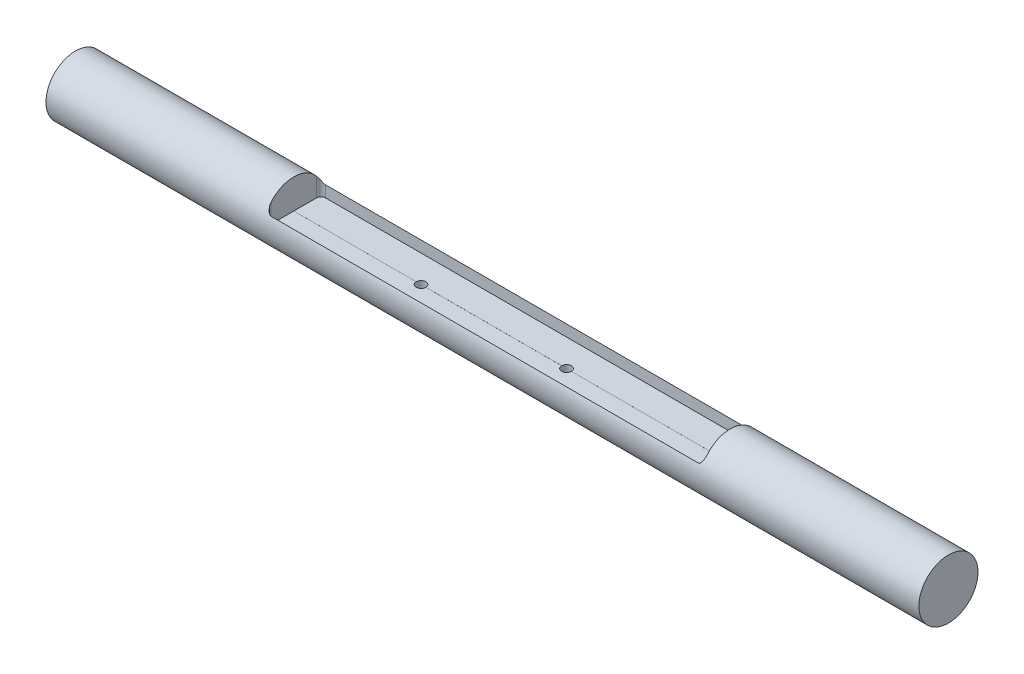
ISO-10303-21;
HEADER;
FILE_DESCRIPTION(('STEP AP214'),'2;1');
FILE_NAME('part.step','',(''),(''),'','','');
FILE_SCHEMA(('AUTOMOTIVE_DESIGN { 1 0 10303 214 1 1 1 1 }'));
ENDSEC;
DATA;
#1=APPLICATION_CONTEXT('core data for automotive mechanical design processes');
#2=APPLICATION_PROTOCOL_DEFINITION('international standard','automotive_design',2000,#1);
#3=PRODUCT_CONTEXT('',#1,'mechanical');
#4=PRODUCT('Part','Part','',(#3));
#5=PRODUCT_RELATED_PRODUCT_CATEGORY('part','',(#4));
#6=PRODUCT_DEFINITION_FORMATION('','',#4);
#7=PRODUCT_DEFINITION_CONTEXT('part definition',#1,'design');
#8=PRODUCT_DEFINITION('design','',#6,#7);
#9=PRODUCT_DEFINITION_SHAPE('','',#8);
#10=(LENGTH_UNIT() NAMED_UNIT(*) SI_UNIT(.MILLI.,.METRE.));
#11=(NAMED_UNIT(*) PLANE_ANGLE_UNIT() SI_UNIT($,.RADIAN.));
#12=(NAMED_UNIT(*) SI_UNIT($,.STERADIAN.) SOLID_ANGLE_UNIT());
#13=UNCERTAINTY_MEASURE_WITH_UNIT(LENGTH_MEASURE(1.E-05),#10,'distance_accuracy_value','');
#14=(GEOMETRIC_REPRESENTATION_CONTEXT(3) GLOBAL_UNCERTAINTY_ASSIGNED_CONTEXT((#13)) GLOBAL_UNIT_ASSIGNED_CONTEXT((#10,
#11,#12)) REPRESENTATION_CONTEXT('',''));
#15=CARTESIAN_POINT('',(0.,0.,0.));
#16=DIRECTION('',(0.,0.,1.));
#17=DIRECTION('',(1.,0.,0.));
#18=AXIS2_PLACEMENT_3D('',#15,#16,#17);
#19=CARTESIAN_POINT('',(304.8,0.,0.));
#20=DIRECTION('',(-1.,0.,0.));
#21=DIRECTION('',(0.,0.,1.));
#22=AXIS2_PLACEMENT_3D('',#19,#20,#21);
#23=CYLINDRICAL_SURFACE('',#22,0.0127000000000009);
#24=CARTESIAN_POINT('',(41.4781761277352,0.,0.0127000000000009));
#25=CARTESIAN_POINT('',(41.4781761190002,-0.000714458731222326,0.0127006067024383));
#26=CARTESIAN_POINT('',(41.4781763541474,-0.00142873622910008,0.0126397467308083));
#27=CARTESIAN_POINT('',(41.4781772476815,-0.00283657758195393,0.0123995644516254));
#28=CARTESIAN_POINT('',(41.4781779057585,-0.0035301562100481,0.0122203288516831));
#29=CARTESIAN_POINT('',(41.4781795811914,-0.00487766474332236,0.0117477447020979));
#30=CARTESIAN_POINT('',(41.4781805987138,-0.0055315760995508,0.011454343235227));
#31=CARTESIAN_POINT('',(41.4781828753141,-0.00678074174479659,0.010762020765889));
#32=CARTESIAN_POINT('',(41.4781841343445,-0.00737600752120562,0.0103631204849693));
#33=CARTESIAN_POINT('',(41.4781867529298,-0.00849114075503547,0.00947103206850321));
#34=CARTESIAN_POINT('',(41.4781881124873,-0.00901100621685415,0.00897784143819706));
#35=CARTESIAN_POINT('',(41.478190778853,-0.00996063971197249,0.00791110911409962));
#36=CARTESIAN_POINT('',(41.478192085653,-0.0103903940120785,0.00733755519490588));
#37=CARTESIAN_POINT('',(41.4781944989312,-0.011147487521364,0.00612645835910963));
#38=CARTESIAN_POINT('',(41.4781956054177,-0.0114748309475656,0.00548891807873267));
#39=CARTESIAN_POINT('',(41.4781974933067,-0.0120178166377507,0.00416797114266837));
#40=CARTESIAN_POINT('',(41.4781982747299,-0.012233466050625,0.00348456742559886));
#41=CARTESIAN_POINT('',(41.4781994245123,-0.0125469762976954,0.00209124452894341));
#42=CARTESIAN_POINT('',(41.4781997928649,-0.0126448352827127,0.00138132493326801));
#43=CARTESIAN_POINT('',(41.4782000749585,-0.0127199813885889,-4.48836769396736E-05));
#44=CARTESIAN_POINT('',(41.478199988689,-0.0126972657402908,-0.000761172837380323));
#45=CARTESIAN_POINT('',(41.478199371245,-0.0125319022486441,-0.00217975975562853));
#46=CARTESIAN_POINT('',(41.4781988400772,-0.0123892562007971,-0.00288205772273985));
#47=CARTESIAN_POINT('',(41.4781973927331,-0.0119880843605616,-0.00425273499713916));
#48=CARTESIAN_POINT('',(41.478196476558,-0.0117295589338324,-0.00492111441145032));
#49=CARTESIAN_POINT('',(41.4781943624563,-0.0111039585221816,-0.00620500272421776));
#50=CARTESIAN_POINT('',(41.4781931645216,-0.0107368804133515,-0.0068205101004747));
#51=CARTESIAN_POINT('',(41.4781906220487,-0.00990461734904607,-0.00798113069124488));
#52=CARTESIAN_POINT('',(41.4781892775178,-0.00943943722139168,-0.00852624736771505));
#53=CARTESIAN_POINT('',(41.4781865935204,-0.00842423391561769,-0.00953058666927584));
#54=CARTESIAN_POINT('',(41.4781852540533,-0.00787422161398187,-0.00998982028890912));
#55=CARTESIAN_POINT('',(41.4781827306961,-0.00670471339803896,-0.0108095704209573));
#56=CARTESIAN_POINT('',(41.4781815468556,-0.00608519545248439,-0.01117005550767));
#57=CARTESIAN_POINT('',(41.4781794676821,-0.00479408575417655,-0.0117820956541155));
#58=CARTESIAN_POINT('',(41.4781785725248,-0.0041224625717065,-0.0120335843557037));
#59=CARTESIAN_POINT('',(41.4781771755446,-0.00274736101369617,-0.012419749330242));
#60=CARTESIAN_POINT('',(41.4781766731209,-0.0020439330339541,-0.0125546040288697));
#61=CARTESIAN_POINT('',(41.478176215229,-0.000891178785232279,-0.012676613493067));
#62=CARTESIAN_POINT('',(41.4781761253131,-0.000445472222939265,-0.0127001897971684));
#63=CARTESIAN_POINT('',(41.4781761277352,0.,-0.0127000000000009));
#64=B_SPLINE_CURVE_WITH_KNOTS('',3,(#24,#25,#26,#27,#28,#29,#30,#31,#32,#33,#34,#35,#36,#37,#38,
#39,#40,#41,#42,#43,#44,#45,#46,#47,#48,#49,#50,#51,#52,#53,#54,#55,#56,#57,#58,#59,#60,#61,#62,
#63),.UNSPECIFIED.,.F.,.F.,(4,2,2,2,2,2,2,2,2,2,2,2,2,2,2,2,2,2,2,4),(0.,0.00214052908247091,
0.00427949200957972,0.00641944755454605,0.00855898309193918,0.0106985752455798,
0.0128384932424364,0.014978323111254,0.0171180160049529,0.0192577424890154,0.02139751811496,
0.0235372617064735,0.0256769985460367,0.027816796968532,0.0299564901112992,0.032095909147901,
0.0342360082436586,0.0363774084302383,0.0385155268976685,0.0398519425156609),.UNSPECIFIED.);
#65=CARTESIAN_POINT('',(41.4781761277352,0.,0.0127000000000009));
#66=VERTEX_POINT('',#65);
#67=CARTESIAN_POINT('',(41.4781761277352,0.,-0.0127000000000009));
#68=VERTEX_POINT('',#67);
#69=EDGE_CURVE('E258',#66,#68,#64,.T.);
#70=ORIENTED_EDGE('',*,*,#69,.F.);
#71=DIRECTION('',(-1.,0.,0.));
#72=VECTOR('',#71,1.);
#73=CARTESIAN_POINT('',(304.8,0.,0.0127000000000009));
#74=LINE('',#73,#72);
#75=CARTESIAN_POINT('',(152.4,0.,0.0127000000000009));
#76=VERTEX_POINT('',#75);
#77=EDGE_CURVE('E156',#66,#76,#74,.F.);
#78=ORIENTED_EDGE('',*,*,#77,.T.);
#79=CARTESIAN_POINT('',(152.4,0.,0.));
#80=DIRECTION('',(-1.,0.,0.));
#81=DIRECTION('',(0.,0.,1.));
#82=AXIS2_PLACEMENT_3D('',#79,#80,#81);
#83=CIRCLE('',#82,0.0127000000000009);
#84=CARTESIAN_POINT('',(152.4,0.,-0.0127000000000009));
#85=VERTEX_POINT('',#84);
#86=EDGE_CURVE('E158',#76,#85,#83,.T.);
#87=ORIENTED_EDGE('',*,*,#86,.T.);
#88=DIRECTION('',(-1.,0.,0.));
#89=VECTOR('',#88,1.);
#90=CARTESIAN_POINT('',(304.8,0.,-0.0127000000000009));
#91=LINE('',#90,#89);
#92=EDGE_CURVE('E170',#85,#68,#91,.T.);
#93=ORIENTED_EDGE('',*,*,#92,.T.);
#94=EDGE_LOOP('',(#70,#78,#87,#93));
#95=FACE_BOUND('',#94,.T.);
#96=CARTESIAN_POINT('',(304.8,0.,0.));
#97=DIRECTION('',(1.,0.,0.));
#98=DIRECTION('',(0.,0.,-1.));
#99=AXIS2_PLACEMENT_3D('',#96,#97,#98);
#100=CIRCLE('',#99,0.0127000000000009);
#101=CARTESIAN_POINT('',(304.8,0.,-0.0127000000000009));
#102=VERTEX_POINT('',#101);
#103=EDGE_CURVE('E326',#102,#102,#100,.T.);
#104=ORIENTED_EDGE('',*,*,#103,.T.);
#105=EDGE_LOOP('',(#104));
#106=FACE_BOUND('',#105,.T.);
#107=ADVANCED_FACE('F37',(#95,#106),#23,.F.);
#108=CARTESIAN_POINT('',(34.7218238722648,0.,-0.0127000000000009));
#109=CARTESIAN_POINT('',(34.7218238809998,-0.000714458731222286,-0.0127006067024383));
#110=CARTESIAN_POINT('',(34.7218236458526,-0.0014287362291,-0.0126397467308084));
#111=CARTESIAN_POINT('',(34.7218227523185,-0.00283657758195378,-0.0123995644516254));
#112=CARTESIAN_POINT('',(34.7218220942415,-0.00353015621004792,-0.0122203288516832));
#113=CARTESIAN_POINT('',(34.7218204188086,-0.00487766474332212,-0.011747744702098));
#114=CARTESIAN_POINT('',(34.7218194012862,-0.00553157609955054,-0.0114543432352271));
#115=CARTESIAN_POINT('',(34.7218171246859,-0.00678074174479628,-0.0107620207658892));
#116=CARTESIAN_POINT('',(34.7218158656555,-0.00737600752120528,-0.0103631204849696));
#117=CARTESIAN_POINT('',(34.7218132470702,-0.00849114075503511,-0.00947103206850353));
#118=CARTESIAN_POINT('',(34.7218118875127,-0.00901100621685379,-0.00897784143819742));
#119=CARTESIAN_POINT('',(34.721809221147,-0.00996063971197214,-0.00791110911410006));
#120=CARTESIAN_POINT('',(34.721807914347,-0.0103903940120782,-0.00733755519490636));
#121=CARTESIAN_POINT('',(34.7218055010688,-0.0111474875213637,-0.00612645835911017));
#122=CARTESIAN_POINT('',(34.7218043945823,-0.0114748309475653,-0.00548891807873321));
#123=CARTESIAN_POINT('',(34.7218025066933,-0.0120178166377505,-0.00416797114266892));
#124=CARTESIAN_POINT('',(34.7218017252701,-0.0122334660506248,-0.00348456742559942));
#125=CARTESIAN_POINT('',(34.7218005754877,-0.0125469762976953,-0.00209124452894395));
#126=CARTESIAN_POINT('',(34.7218002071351,-0.0126448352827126,-0.00138132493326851));
#127=CARTESIAN_POINT('',(34.7217999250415,-0.0127199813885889,4.48836769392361E-05));
#128=CARTESIAN_POINT('',(34.721800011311,-0.0126972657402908,0.000761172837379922));
#129=CARTESIAN_POINT('',(34.721800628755,-0.0125319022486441,0.00217975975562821));
#130=CARTESIAN_POINT('',(34.7218011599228,-0.0123892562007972,0.00288205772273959));
#131=CARTESIAN_POINT('',(34.7218026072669,-0.0119880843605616,0.004252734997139));
#132=CARTESIAN_POINT('',(34.7218035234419,-0.0117295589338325,0.0049211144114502));
#133=CARTESIAN_POINT('',(34.7218056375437,-0.0111039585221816,0.00620500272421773));
#134=CARTESIAN_POINT('',(34.7218068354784,-0.0107368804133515,0.00682051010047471));
#135=CARTESIAN_POINT('',(34.7218093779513,-0.00990461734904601,0.00798113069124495));
#136=CARTESIAN_POINT('',(34.7218107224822,-0.00943943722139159,0.00852624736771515));
#137=CARTESIAN_POINT('',(34.7218134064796,-0.00842423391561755,0.00953058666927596));
#138=CARTESIAN_POINT('',(34.7218147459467,-0.00787422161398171,0.00998982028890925));
#139=CARTESIAN_POINT('',(34.7218172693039,-0.00670471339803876,0.0108095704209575));
#140=CARTESIAN_POINT('',(34.7218184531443,-0.00608519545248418,0.0111700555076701));
#141=CARTESIAN_POINT('',(34.7218205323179,-0.00479408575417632,0.0117820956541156));
#142=CARTESIAN_POINT('',(34.7218214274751,-0.00412246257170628,0.0120335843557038));
#143=CARTESIAN_POINT('',(34.7218228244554,-0.00274736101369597,0.0124197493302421));
#144=CARTESIAN_POINT('',(34.7218233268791,-0.00204393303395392,0.0125546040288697));
#145=CARTESIAN_POINT('',(34.721823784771,-0.000891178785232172,0.012676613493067));
#146=CARTESIAN_POINT('',(34.7218238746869,-0.000445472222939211,0.0127001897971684));
#147=CARTESIAN_POINT('',(34.7218238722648,0.,0.0127000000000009));
#148=B_SPLINE_CURVE_WITH_KNOTS('',3,(#108,#109,#110,#111,#112,#113,#114,#115,#116,#117,#118,
#119,#120,#121,#122,#123,#124,#125,#126,#127,#128,#129,#130,#131,#132,#133,#134,#135,#136,#137,
#138,#139,#140,#141,#142,#143,#144,#145,#146,#147),.UNSPECIFIED.,.F.,.F.,(4,2,2,2,2,2,2,2,2,2,2,
2,2,2,2,2,2,2,2,4),(0.,0.0021405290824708,0.0042794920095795,0.00641944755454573,
0.00855898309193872,0.0106985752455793,0.0128384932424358,0.0149783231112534,0.0171180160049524,
0.0192577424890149,0.0213975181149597,0.0235372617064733,0.0256769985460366,0.0278167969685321,
0.0299564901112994,0.0320959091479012,0.0342360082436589,0.0363774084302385,0.0385155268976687,
0.0398519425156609),.UNSPECIFIED.);
#149=CARTESIAN_POINT('',(34.7218238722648,0.,-0.0127000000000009));
#150=VERTEX_POINT('',#149);
#151=CARTESIAN_POINT('',(34.7218238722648,0.,0.0127000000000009));
#152=VERTEX_POINT('',#151);
#153=EDGE_CURVE('E52',#150,#152,#148,.T.);
#154=ORIENTED_EDGE('',*,*,#153,.F.);
#155=CARTESIAN_POINT('',(-60.1218238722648,0.,-0.0127000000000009));
#156=VERTEX_POINT('',#155);
#157=EDGE_CURVE('E150',#150,#156,#91,.T.);
#158=ORIENTED_EDGE('',*,*,#157,.T.);
#159=CARTESIAN_POINT('',(-60.1218238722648,0.,0.0127000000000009));
#160=CARTESIAN_POINT('',(-60.1218238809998,-0.000714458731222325,0.0127006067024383));
#161=CARTESIAN_POINT('',(-60.1218236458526,-0.00142873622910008,0.0126397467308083));
#162=CARTESIAN_POINT('',(-60.1218227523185,-0.00283657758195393,0.0123995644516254));
#163=CARTESIAN_POINT('',(-60.1218220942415,-0.0035301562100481,0.0122203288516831));
#164=CARTESIAN_POINT('',(-60.1218204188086,-0.00487766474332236,0.0117477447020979));
#165=CARTESIAN_POINT('',(-60.1218194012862,-0.00553157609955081,0.011454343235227));
#166=CARTESIAN_POINT('',(-60.1218171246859,-0.0067807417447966,0.010762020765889));
#167=CARTESIAN_POINT('',(-60.1218158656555,-0.00737600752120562,0.0103631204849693));
#168=CARTESIAN_POINT('',(-60.1218132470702,-0.00849114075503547,0.00947103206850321));
#169=CARTESIAN_POINT('',(-60.1218118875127,-0.00901100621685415,0.00897784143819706));
#170=CARTESIAN_POINT('',(-60.121809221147,-0.00996063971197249,0.00791110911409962));
#171=CARTESIAN_POINT('',(-60.121807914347,-0.0103903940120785,0.00733755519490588));
#172=CARTESIAN_POINT('',(-60.1218055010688,-0.011147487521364,0.00612645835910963));
#173=CARTESIAN_POINT('',(-60.1218043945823,-0.0114748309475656,0.00548891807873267));
#174=CARTESIAN_POINT('',(-60.1218025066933,-0.0120178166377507,0.00416797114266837));
#175=CARTESIAN_POINT('',(-60.1218017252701,-0.012233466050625,0.00348456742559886));
#176=CARTESIAN_POINT('',(-60.1218005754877,-0.0125469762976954,0.00209124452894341));
#177=CARTESIAN_POINT('',(-60.1218002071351,-0.0126448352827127,0.00138132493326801));
#178=CARTESIAN_POINT('',(-60.1217999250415,-0.0127199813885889,-4.48836769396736E-05));
#179=CARTESIAN_POINT('',(-60.121800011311,-0.0126972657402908,-0.000761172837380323));
#180=CARTESIAN_POINT('',(-60.121800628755,-0.0125319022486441,-0.00217975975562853));
#181=CARTESIAN_POINT('',(-60.1218011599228,-0.0123892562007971,-0.00288205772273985));
#182=CARTESIAN_POINT('',(-60.1218026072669,-0.0119880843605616,-0.00425273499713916));
#183=CARTESIAN_POINT('',(-60.121803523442,-0.0117295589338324,-0.00492111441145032));
#184=CARTESIAN_POINT('',(-60.1218056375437,-0.0111039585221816,-0.00620500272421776));
#185=CARTESIAN_POINT('',(-60.1218068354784,-0.0107368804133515,-0.0068205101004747));
#186=CARTESIAN_POINT('',(-60.1218093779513,-0.00990461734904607,-0.00798113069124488));
#187=CARTESIAN_POINT('',(-60.1218107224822,-0.00943943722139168,-0.00852624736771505));
#188=CARTESIAN_POINT('',(-60.1218134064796,-0.00842423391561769,-0.00953058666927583));
#189=CARTESIAN_POINT('',(-60.1218147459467,-0.00787422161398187,-0.00998982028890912));
#190=CARTESIAN_POINT('',(-60.1218172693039,-0.00670471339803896,-0.0108095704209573));
#191=CARTESIAN_POINT('',(-60.1218184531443,-0.00608519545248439,-0.01117005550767));
#192=CARTESIAN_POINT('',(-60.1218205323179,-0.00479408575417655,-0.0117820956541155));
#193=CARTESIAN_POINT('',(-60.1218214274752,-0.0041224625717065,-0.0120335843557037));
#194=CARTESIAN_POINT('',(-60.1218228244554,-0.00274736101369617,-0.012419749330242));
#195=CARTESIAN_POINT('',(-60.1218233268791,-0.00204393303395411,-0.0125546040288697));
#196=CARTESIAN_POINT('',(-60.121823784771,-0.000891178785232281,-0.012676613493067));
#197=CARTESIAN_POINT('',(-60.1218238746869,-0.000445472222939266,-0.0127001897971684));
#198=CARTESIAN_POINT('',(-60.1218238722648,0.,-0.0127000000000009));
#199=B_SPLINE_CURVE_WITH_KNOTS('',3,(#159,#160,#161,#162,#163,#164,#165,#166,#167,#168,#169,
#170,#171,#172,#173,#174,#175,#176,#177,#178,#179,#180,#181,#182,#183,#184,#185,#186,#187,#188,
#189,#190,#191,#192,#193,#194,#195,#196,#197,#198),.UNSPECIFIED.,.F.,.F.,(4,2,2,2,2,2,2,2,2,2,2,
2,2,2,2,2,2,2,2,4),(0.,0.00214052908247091,0.00427949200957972,0.00641944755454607,
0.00855898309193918,0.0106985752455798,0.0128384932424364,0.014978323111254,0.0171180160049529,
0.0192577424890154,0.02139751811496,0.0235372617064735,0.0256769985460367,0.027816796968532,
0.0299564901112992,0.032095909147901,0.0342360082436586,0.0363774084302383,0.0385155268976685,
0.0398519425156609),.UNSPECIFIED.);
#200=CARTESIAN_POINT('',(-60.1218238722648,0.,0.0127000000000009));
#201=VERTEX_POINT('',#200);
#202=EDGE_CURVE('E138',#201,#156,#199,.T.);
#203=ORIENTED_EDGE('',*,*,#202,.F.);
#204=EDGE_CURVE('E148',#201,#152,#74,.F.);
#205=ORIENTED_EDGE('',*,*,#204,.T.);
#206=EDGE_LOOP('',(#154,#158,#203,#205));
#207=FACE_BOUND('',#206,.T.);
#208=ADVANCED_FACE('F147',(#207),#23,.F.);
#209=CARTESIAN_POINT('',(304.8,0.,0.));
#210=DIRECTION('',(-1.,0.,0.));
#211=DIRECTION('',(0.,0.,1.));
#212=AXIS2_PLACEMENT_3D('',#209,#210,#211);
#213=CYLINDRICAL_SURFACE('',#212,20.6375);
#214=CARTESIAN_POINT('',(34.7218,-20.6375,0.));
#215=CARTESIAN_POINT('',(34.7218075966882,-20.6374968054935,0.188405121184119));
#216=CARTESIAN_POINT('',(34.7376145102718,-20.6348930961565,0.376914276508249));
#217=CARTESIAN_POINT('',(34.8004001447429,-20.6247570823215,0.748648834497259));
#218=CARTESIAN_POINT('',(34.8474078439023,-20.6172201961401,0.931869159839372));
#219=CARTESIAN_POINT('',(34.971140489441,-20.5980634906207,1.28759375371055));
#220=CARTESIAN_POINT('',(35.0478414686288,-20.5864469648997,1.46010653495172));
#221=CARTESIAN_POINT('',(35.228721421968,-20.5604094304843,1.78979096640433));
#222=CARTESIAN_POINT('',(35.3328971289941,-20.5459887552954,1.94696443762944));
#223=CARTESIAN_POINT('',(35.566793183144,-20.5157935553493,2.24298312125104));
#224=CARTESIAN_POINT('',(35.6967175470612,-20.5000088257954,2.38166610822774));
#225=CARTESIAN_POINT('',(35.9779837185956,-20.4689429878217,2.63536611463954));
#226=CARTESIAN_POINT('',(36.1293268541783,-20.4536619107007,2.75038166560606));
#227=CARTESIAN_POINT('',(36.4502443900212,-20.4252346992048,2.95412863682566));
#228=CARTESIAN_POINT('',(36.6199215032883,-20.4121017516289,3.04270027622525));
#229=CARTESIAN_POINT('',(36.9719959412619,-20.3895989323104,3.1900235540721));
#230=CARTESIAN_POINT('',(37.1543924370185,-20.3802288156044,3.24877713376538));
#231=CARTESIAN_POINT('',(37.5250108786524,-20.3664139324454,3.33428670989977));
#232=CARTESIAN_POINT('',(37.7131666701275,-20.3619261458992,3.36132235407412));
#233=CARTESIAN_POINT('',(38.0913935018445,-20.358253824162,3.38349553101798));
#234=CARTESIAN_POINT('',(38.28146441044,-20.3590689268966,3.37863524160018));
#235=CARTESIAN_POINT('',(38.656133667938,-20.3658709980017,3.33738243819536));
#236=CARTESIAN_POINT('',(38.8407676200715,-20.3718065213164,3.30130356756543));
#237=CARTESIAN_POINT('',(39.2013257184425,-20.3881001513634,3.19912973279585));
#238=CARTESIAN_POINT('',(39.3772495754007,-20.3984584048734,3.13303377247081));
#239=CARTESIAN_POINT('',(39.7163354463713,-20.4224861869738,2.97238246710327));
#240=CARTESIAN_POINT('',(39.879434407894,-20.4361708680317,2.87769639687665));
#241=CARTESIAN_POINT('',(40.1875479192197,-20.4652989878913,2.66264552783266));
#242=CARTESIAN_POINT('',(40.3325610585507,-20.4807425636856,2.54227872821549));
#243=CARTESIAN_POINT('',(40.6022024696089,-20.5118746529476,2.27757191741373));
#244=CARTESIAN_POINT('',(40.7265665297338,-20.5275638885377,2.13296269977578));
#245=CARTESIAN_POINT('',(40.9493034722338,-20.5572488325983,1.82478775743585));
#246=CARTESIAN_POINT('',(41.0476761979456,-20.5712445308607,1.66122191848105));
#247=CARTESIAN_POINT('',(41.2156601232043,-20.5959843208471,1.3195319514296));
#248=CARTESIAN_POINT('',(41.2852485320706,-20.6067258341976,1.14139642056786));
#249=CARTESIAN_POINT('',(41.3934461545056,-20.6237261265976,0.775751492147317));
#250=CARTESIAN_POINT('',(41.4320578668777,-20.6299852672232,0.588242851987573));
#251=CARTESIAN_POINT('',(41.4768491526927,-20.6372670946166,0.211452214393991));
#252=CARTESIAN_POINT('',(41.4833915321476,-20.6383483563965,0.0222144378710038));
#253=CARTESIAN_POINT('',(41.4648249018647,-20.6353128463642,-0.354653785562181));
#254=CARTESIAN_POINT('',(41.4397170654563,-20.6311962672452,-0.542284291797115));
#255=CARTESIAN_POINT('',(41.3588644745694,-20.6182638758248,-0.909495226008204));
#256=CARTESIAN_POINT('',(41.3032988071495,-20.6094755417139,-1.08911613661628));
#257=CARTESIAN_POINT('',(41.1632983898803,-20.5881812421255,-1.43649280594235));
#258=CARTESIAN_POINT('',(41.0788620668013,-20.5756750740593,-1.60424791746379));
#259=CARTESIAN_POINT('',(40.8826824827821,-20.5481875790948,-1.92471055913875));
#260=CARTESIAN_POINT('',(40.77071193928,-20.5331860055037,-2.0772771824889));
#261=CARTESIAN_POINT('',(40.5229556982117,-20.5024343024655,-2.3615842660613));
#262=CARTESIAN_POINT('',(40.3871683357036,-20.4866841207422,-2.49332326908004));
#263=CARTESIAN_POINT('',(40.0940079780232,-20.4560216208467,-2.73357579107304));
#264=CARTESIAN_POINT('',(39.9364331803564,-20.4411192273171,-2.84184453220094));
#265=CARTESIAN_POINT('',(39.6051198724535,-20.414023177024,-3.03037516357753));
#266=CARTESIAN_POINT('',(39.4313818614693,-20.4018294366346,-3.11063791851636));
#267=CARTESIAN_POINT('',(39.0733667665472,-20.3816053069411,-3.24050964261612));
#268=CARTESIAN_POINT('',(38.8891353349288,-20.3735582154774,-3.29024174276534));
#269=CARTESIAN_POINT('',(38.5147915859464,-20.3624961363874,-3.35802877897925));
#270=CARTESIAN_POINT('',(38.3246797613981,-20.3594807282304,-3.37608636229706));
#271=CARTESIAN_POINT('',(37.9464152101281,-20.3588411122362,-3.37993995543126));
#272=CARTESIAN_POINT('',(37.7582664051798,-20.3611525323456,-3.36612117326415));
#273=CARTESIAN_POINT('',(37.3870089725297,-20.370765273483,-3.30744585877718));
#274=CARTESIAN_POINT('',(37.2039003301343,-20.3780665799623,-3.26258941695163));
#275=CARTESIAN_POINT('',(36.8480621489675,-20.3968123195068,-3.143257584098));
#276=CARTESIAN_POINT('',(36.6753216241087,-20.4082522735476,-3.06881420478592));
#277=CARTESIAN_POINT('',(36.3447194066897,-20.4339908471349,-2.89246098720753));
#278=CARTESIAN_POINT('',(36.1868584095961,-20.4482896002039,-2.79054986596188));
#279=CARTESIAN_POINT('',(35.8885480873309,-20.4783392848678,-2.56077464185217));
#280=CARTESIAN_POINT('',(35.7483187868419,-20.494104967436,-2.43262677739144));
#281=CARTESIAN_POINT('',(35.4912216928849,-20.5251934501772,-2.15461447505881));
#282=CARTESIAN_POINT('',(35.3743593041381,-20.540516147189,-2.00474502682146));
#283=CARTESIAN_POINT('',(35.1666069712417,-20.5691098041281,-1.68636320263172));
#284=CARTESIAN_POINT('',(35.0758946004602,-20.5823664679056,-1.51773366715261));
#285=CARTESIAN_POINT('',(34.9242225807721,-20.6051951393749,-1.1674840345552));
#286=CARTESIAN_POINT('',(34.8632330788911,-20.6147708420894,-0.985877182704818));
#287=CARTESIAN_POINT('',(34.786087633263,-20.6270510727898,-0.669619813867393));
#288=CARTESIAN_POINT('',(34.7620180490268,-20.6309486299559,-0.536890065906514));
#289=CARTESIAN_POINT('',(34.7298716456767,-20.6361742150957,-0.269457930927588));
#290=CARTESIAN_POINT('',(34.7217945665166,-20.6375022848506,-0.134755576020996));
#291=CARTESIAN_POINT('',(34.7218,-20.6375,0.));
#292=B_SPLINE_CURVE_WITH_KNOTS('',3,(#214,#215,#216,#217,#218,#219,#220,#221,#222,#223,#224,
#225,#226,#227,#228,#229,#230,#231,#232,#233,#234,#235,#236,#237,#238,#239,#240,#241,#242,#243,
#244,#245,#246,#247,#248,#249,#250,#251,#252,#253,#254,#255,#256,#257,#258,#259,#260,#261,#262,
#263,#264,#265,#266,#267,#268,#269,#270,#271,#272,#273,#274,#275,#276,#277,#278,#279,#280,#281,
#282,#283,#284,#285,#286,#287,#288,#289,#290,#291),.UNSPECIFIED.,.T.,.F.,(4,2,2,2,2,2,2,2,2,2,2,
2,2,2,2,2,2,2,2,2,2,2,2,2,2,2,2,2,2,2,2,2,2,2,2,2,2,2,4),(0.,0.564722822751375,1.12997087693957,
1.69476363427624,2.25948926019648,2.82888250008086,3.39831105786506,3.97111367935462,
4.54387900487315,5.1115555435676,5.67919332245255,6.24119357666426,6.80321248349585,
7.36784110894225,7.93251374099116,8.50393194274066,9.07535358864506,9.64722680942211,
10.2190538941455,10.7843966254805,11.3497183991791,11.911751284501,12.4738148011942,
13.0406835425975,13.6075919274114,14.1801551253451,14.7527006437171,15.322921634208,
15.8930949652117,16.4564142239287,17.0197318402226,17.5824416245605,18.1451776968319,
18.7143561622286,19.2836661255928,19.8567555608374,20.4292682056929,20.8331892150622,
21.2371036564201),.UNSPECIFIED.);
#293=CARTESIAN_POINT('',(34.7218,-20.6375,0.));
#294=VERTEX_POINT('',#293);
#295=EDGE_CURVE('E273',#294,#294,#292,.T.);
#296=ORIENTED_EDGE('',*,*,#295,.T.);
#297=EDGE_LOOP('',(#296));
#298=FACE_BOUND('',#297,.T.);
#299=CARTESIAN_POINT('',(-66.8782,-20.6375,0.));
#300=CARTESIAN_POINT('',(-66.8781924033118,-20.6374968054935,0.188405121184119));
#301=CARTESIAN_POINT('',(-66.8623854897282,-20.6348930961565,0.376914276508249));
#302=CARTESIAN_POINT('',(-66.7995998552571,-20.6247570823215,0.74864883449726));
#303=CARTESIAN_POINT('',(-66.7525921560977,-20.6172201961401,0.931869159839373));
#304=CARTESIAN_POINT('',(-66.628859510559,-20.5980634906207,1.28759375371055));
#305=CARTESIAN_POINT('',(-66.5521585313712,-20.5864469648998,1.46010653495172));
#306=CARTESIAN_POINT('',(-66.371278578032,-20.5604094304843,1.78979096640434));
#307=CARTESIAN_POINT('',(-66.2671028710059,-20.5459887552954,1.94696443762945));
#308=CARTESIAN_POINT('',(-66.033206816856,-20.5157935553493,2.24298312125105));
#309=CARTESIAN_POINT('',(-65.9032824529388,-20.5000088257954,2.38166610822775));
#310=CARTESIAN_POINT('',(-65.6220162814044,-20.4689429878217,2.63536611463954));
#311=CARTESIAN_POINT('',(-65.4706731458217,-20.4536619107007,2.75038166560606));
#312=CARTESIAN_POINT('',(-65.1497556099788,-20.4252346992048,2.95412863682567));
#313=CARTESIAN_POINT('',(-64.9800784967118,-20.4121017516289,3.04270027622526));
#314=CARTESIAN_POINT('',(-64.6280040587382,-20.3895989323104,3.19002355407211));
#315=CARTESIAN_POINT('',(-64.4456075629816,-20.3802288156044,3.24877713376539));
#316=CARTESIAN_POINT('',(-64.0749891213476,-20.3664139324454,3.33428670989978));
#317=CARTESIAN_POINT('',(-63.8868333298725,-20.3619261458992,3.36132235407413));
#318=CARTESIAN_POINT('',(-63.5086064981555,-20.358253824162,3.38349553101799));
#319=CARTESIAN_POINT('',(-63.31853558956,-20.3590689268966,3.37863524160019));
#320=CARTESIAN_POINT('',(-62.943866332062,-20.3658709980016,3.33738243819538));
#321=CARTESIAN_POINT('',(-62.7592323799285,-20.3718065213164,3.30130356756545));
#322=CARTESIAN_POINT('',(-62.3986742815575,-20.3881001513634,3.19912973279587));
#323=CARTESIAN_POINT('',(-62.2227504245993,-20.3984584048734,3.13303377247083));
#324=CARTESIAN_POINT('',(-61.8836645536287,-20.4224861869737,2.97238246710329));
#325=CARTESIAN_POINT('',(-61.720565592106,-20.4361708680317,2.87769639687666));
#326=CARTESIAN_POINT('',(-61.4124520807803,-20.4652989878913,2.66264552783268));
#327=CARTESIAN_POINT('',(-61.2674389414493,-20.4807425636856,2.54227872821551));
#328=CARTESIAN_POINT('',(-60.9977975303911,-20.5118746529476,2.27757191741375));
#329=CARTESIAN_POINT('',(-60.8734334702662,-20.5275638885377,2.1329626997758));
#330=CARTESIAN_POINT('',(-60.6506965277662,-20.5572488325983,1.82478775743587));
#331=CARTESIAN_POINT('',(-60.5523238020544,-20.5712445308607,1.66122191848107));
#332=CARTESIAN_POINT('',(-60.3843398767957,-20.5959843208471,1.31953195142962));
#333=CARTESIAN_POINT('',(-60.3147514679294,-20.6067258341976,1.14139642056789));
#334=CARTESIAN_POINT('',(-60.2065538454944,-20.6237261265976,0.775751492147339));
#335=CARTESIAN_POINT('',(-60.1679421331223,-20.6299852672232,0.588242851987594));
#336=CARTESIAN_POINT('',(-60.1231508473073,-20.6372670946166,0.211452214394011));
#337=CARTESIAN_POINT('',(-60.1166084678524,-20.6383483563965,0.0222144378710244));
#338=CARTESIAN_POINT('',(-60.1351750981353,-20.6353128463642,-0.35465378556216));
#339=CARTESIAN_POINT('',(-60.1602829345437,-20.6311962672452,-0.542284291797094));
#340=CARTESIAN_POINT('',(-60.2411355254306,-20.6182638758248,-0.909495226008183));
#341=CARTESIAN_POINT('',(-60.2967011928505,-20.6094755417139,-1.08911613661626));
#342=CARTESIAN_POINT('',(-60.4367016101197,-20.5881812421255,-1.43649280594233));
#343=CARTESIAN_POINT('',(-60.5211379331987,-20.5756750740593,-1.60424791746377));
#344=CARTESIAN_POINT('',(-60.7173175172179,-20.5481875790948,-1.92471055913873));
#345=CARTESIAN_POINT('',(-60.8292880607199,-20.5331860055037,-2.07727718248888));
#346=CARTESIAN_POINT('',(-61.0770443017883,-20.5024343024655,-2.36158426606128));
#347=CARTESIAN_POINT('',(-61.2128316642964,-20.4866841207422,-2.49332326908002));
#348=CARTESIAN_POINT('',(-61.5059920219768,-20.4560216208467,-2.73357579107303));
#349=CARTESIAN_POINT('',(-61.6635668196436,-20.4411192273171,-2.84184453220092));
#350=CARTESIAN_POINT('',(-61.9948801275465,-20.414023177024,-3.03037516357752));
#351=CARTESIAN_POINT('',(-62.1686181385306,-20.4018294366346,-3.11063791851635));
#352=CARTESIAN_POINT('',(-62.5266332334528,-20.3816053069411,-3.2405096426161));
#353=CARTESIAN_POINT('',(-62.7108646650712,-20.3735582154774,-3.29024174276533));
#354=CARTESIAN_POINT('',(-63.0852084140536,-20.3624961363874,-3.35802877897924));
#355=CARTESIAN_POINT('',(-63.2753202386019,-20.3594807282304,-3.37608636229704));
#356=CARTESIAN_POINT('',(-63.6535847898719,-20.3588411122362,-3.37993995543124));
#357=CARTESIAN_POINT('',(-63.8417335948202,-20.3611525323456,-3.36612117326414));
#358=CARTESIAN_POINT('',(-64.2129910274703,-20.370765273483,-3.30744585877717));
#359=CARTESIAN_POINT('',(-64.3960996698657,-20.3780665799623,-3.26258941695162));
#360=CARTESIAN_POINT('',(-64.7519378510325,-20.3968123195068,-3.14325758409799));
#361=CARTESIAN_POINT('',(-64.9246783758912,-20.4082522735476,-3.06881420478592));
#362=CARTESIAN_POINT('',(-65.2552805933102,-20.4339908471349,-2.89246098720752));
#363=CARTESIAN_POINT('',(-65.4131415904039,-20.4482896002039,-2.79054986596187));
#364=CARTESIAN_POINT('',(-65.7114519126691,-20.4783392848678,-2.56077464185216));
#365=CARTESIAN_POINT('',(-65.8516812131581,-20.494104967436,-2.43262677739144));
#366=CARTESIAN_POINT('',(-66.108778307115,-20.5251934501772,-2.15461447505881));
#367=CARTESIAN_POINT('',(-66.2256406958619,-20.540516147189,-2.00474502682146));
#368=CARTESIAN_POINT('',(-66.4333930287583,-20.5691098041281,-1.68636320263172));
#369=CARTESIAN_POINT('',(-66.5241053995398,-20.5823664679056,-1.51773366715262));
#370=CARTESIAN_POINT('',(-66.6757774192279,-20.6051951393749,-1.1674840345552));
#371=CARTESIAN_POINT('',(-66.7367669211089,-20.6147708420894,-0.98587718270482));
#372=CARTESIAN_POINT('',(-66.813912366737,-20.6270510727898,-0.669619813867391));
#373=CARTESIAN_POINT('',(-66.8379819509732,-20.6309486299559,-0.53689006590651));
#374=CARTESIAN_POINT('',(-66.8701283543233,-20.6361742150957,-0.269457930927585));
#375=CARTESIAN_POINT('',(-66.8782054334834,-20.6375022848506,-0.134755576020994));
#376=CARTESIAN_POINT('',(-66.8782,-20.6375,0.));
#377=B_SPLINE_CURVE_WITH_KNOTS('',3,(#299,#300,#301,#302,#303,#304,#305,#306,#307,#308,#309,
#310,#311,#312,#313,#314,#315,#316,#317,#318,#319,#320,#321,#322,#323,#324,#325,#326,#327,#328,
#329,#330,#331,#332,#333,#334,#335,#336,#337,#338,#339,#340,#341,#342,#343,#344,#345,#346,#347,
#348,#349,#350,#351,#352,#353,#354,#355,#356,#357,#358,#359,#360,#361,#362,#363,#364,#365,#366,
#367,#368,#369,#370,#371,#372,#373,#374,#375,#376),.UNSPECIFIED.,.T.,.F.,(4,2,2,2,2,2,2,2,2,2,2,
2,2,2,2,2,2,2,2,2,2,2,2,2,2,2,2,2,2,2,2,2,2,2,2,2,2,2,4),(0.,0.564722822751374,1.12997087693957,
1.69476363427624,2.25948926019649,2.82888250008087,3.39831105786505,3.9711136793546,
4.54387900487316,5.1115555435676,5.67919332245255,6.24119357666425,6.80321248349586,
7.36784110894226,7.93251374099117,8.50393194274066,9.07535358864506,9.64722680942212,
10.2190538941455,10.7843966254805,11.3497183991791,11.911751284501,12.4738148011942,
13.0406835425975,13.6075919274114,14.1801551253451,14.7527006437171,15.3229216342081,
15.8930949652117,16.4564142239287,17.0197318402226,17.5824416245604,18.1451776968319,
18.7143561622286,19.2836661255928,19.8567555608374,20.4292682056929,20.8331892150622,
21.2371036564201),.UNSPECIFIED.);
#378=CARTESIAN_POINT('',(-66.8782,-20.6375,0.));
#379=VERTEX_POINT('',#378);
#380=EDGE_CURVE('E151',#379,#379,#377,.T.);
#381=ORIENTED_EDGE('',*,*,#380,.T.);
#382=EDGE_LOOP('',(#381));
#383=FACE_BOUND('',#382,.T.);
#384=CARTESIAN_POINT('',(304.8,0.,0.));
#385=DIRECTION('',(1.,0.,0.));
#386=DIRECTION('',(0.,0.,-1.));
#387=AXIS2_PLACEMENT_3D('',#384,#385,#386);
#388=CIRCLE('',#387,20.6375);
#389=CARTESIAN_POINT('',(304.8,0.,-20.6375));
#390=VERTEX_POINT('',#389);
#391=EDGE_CURVE('E159',#390,#390,#388,.T.);
#392=ORIENTED_EDGE('',*,*,#391,.F.);
#393=EDGE_LOOP('',(#392));
#394=FACE_BOUND('',#393,.T.);
#395=CARTESIAN_POINT('',(-304.8,0.,0.));
#396=DIRECTION('',(1.,0.,0.));
#397=DIRECTION('',(0.,0.,-1.));
#398=AXIS2_PLACEMENT_3D('',#395,#396,#397);
#399=CIRCLE('',#398,20.6375);
#400=CARTESIAN_POINT('',(-304.8,0.,-20.6375));
#401=VERTEX_POINT('',#400);
#402=EDGE_CURVE('E162',#401,#401,#399,.T.);
#403=ORIENTED_EDGE('',*,*,#402,.T.);
#404=EDGE_LOOP('',(#403));
#405=FACE_BOUND('',#404,.T.);
#406=CARTESIAN_POINT('',(152.4,0.,0.));
#407=DIRECTION('',(-1.,0.,0.));
#408=DIRECTION('',(0.,0.,1.));
#409=AXIS2_PLACEMENT_3D('',#406,#407,#408);
#410=CIRCLE('',#409,20.6375);
#411=CARTESIAN_POINT('',(152.4,13.1867653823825,15.875));
#412=VERTEX_POINT('',#411);
#413=CARTESIAN_POINT('',(152.4,13.1867653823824,-15.875));
#414=VERTEX_POINT('',#413);
#415=EDGE_CURVE('E321',#412,#414,#410,.T.);
#416=ORIENTED_EDGE('',*,*,#415,.F.);
#417=CARTESIAN_POINT('',(149.225,7.93750000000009,19.05));
#418=CARTESIAN_POINT('',(149.264402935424,7.93748415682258,19.0500056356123));
#419=CARTESIAN_POINT('',(149.30378061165,7.93926176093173,19.0492659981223));
#420=CARTESIAN_POINT('',(149.382116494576,7.94625383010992,19.0463508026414));
#421=CARTESIAN_POINT('',(149.421075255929,7.95146297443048,19.0441774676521));
#422=CARTESIAN_POINT('',(149.535791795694,7.9718156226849,19.035671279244));
#423=CARTESIAN_POINT('',(149.610592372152,7.99169418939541,19.0273485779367));
#424=CARTESIAN_POINT('',(149.777186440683,8.04930244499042,19.003061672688));
#425=CARTESIAN_POINT('',(149.867492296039,8.09056625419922,18.985568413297));
#426=CARTESIAN_POINT('',(150.04037989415,8.18554573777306,18.9448125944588));
#427=CARTESIAN_POINT('',(150.122906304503,8.23934235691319,18.9215124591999));
#428=CARTESIAN_POINT('',(150.272228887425,8.34928055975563,18.8732392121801));
#429=CARTESIAN_POINT('',(150.339770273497,8.4046155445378,18.8486828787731));
#430=CARTESIAN_POINT('',(150.469502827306,8.52009186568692,18.7967671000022));
#431=CARTESIAN_POINT('',(150.531689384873,8.58023725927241,18.7694052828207));
#432=CARTESIAN_POINT('',(150.651411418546,8.70403278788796,18.7123187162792));
#433=CARTESIAN_POINT('',(150.708942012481,8.76768648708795,18.6825915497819));
#434=CARTESIAN_POINT('',(150.819879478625,8.89756487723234,18.6210881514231));
#435=CARTESIAN_POINT('',(150.873284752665,8.96379054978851,18.5893111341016));
#436=CARTESIAN_POINT('',(151.034390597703,9.17359373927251,18.4872025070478));
#437=CARTESIAN_POINT('',(151.13571342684,9.32051780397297,18.4136492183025));
#438=CARTESIAN_POINT('',(151.325026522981,9.61919453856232,18.2594052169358));
#439=CARTESIAN_POINT('',(151.413003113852,9.77095197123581,18.178707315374));
#440=CARTESIAN_POINT('',(151.577358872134,10.077431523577,18.0106184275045));
#441=CARTESIAN_POINT('',(151.653716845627,10.2321584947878,17.9232156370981));
#442=CARTESIAN_POINT('',(151.795506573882,10.5429637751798,17.7421726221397));
#443=CARTESIAN_POINT('',(151.860936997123,10.6990422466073,17.6485316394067));
#444=CARTESIAN_POINT('',(151.987747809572,11.0286978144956,17.444649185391));
#445=CARTESIAN_POINT('',(152.047899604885,11.2023190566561,17.3337128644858));
#446=CARTESIAN_POINT('',(152.154933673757,11.5490176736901,17.1046712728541));
#447=CARTESIAN_POINT('',(152.201811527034,11.7220948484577,16.9865636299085));
#448=CARTESIAN_POINT('',(152.28143423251,12.0660929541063,16.7439529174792));
#449=CARTESIAN_POINT('',(152.314227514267,12.2370192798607,16.6194734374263));
#450=CARTESIAN_POINT('',(152.364773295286,12.5762890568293,16.3642400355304));
#451=CARTESIAN_POINT('',(152.382536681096,12.7446342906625,16.23349072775));
#452=CARTESIAN_POINT('',(152.394653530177,12.957378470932,16.0628849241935));
#453=CARTESIAN_POINT('',(152.396648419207,13.0034701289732,16.0255948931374));
#454=CARTESIAN_POINT('',(152.399321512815,13.0953492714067,15.950603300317));
#455=CARTESIAN_POINT('',(152.399999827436,13.1411367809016,15.9129017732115));
#456=CARTESIAN_POINT('',(152.4,13.1867653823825,15.875));
#457=B_SPLINE_CURVE_WITH_KNOTS('',3,(#417,#418,#419,#420,#421,#422,#423,#424,#425,#426,#427,
#428,#429,#430,#431,#432,#433,#434,#435,#436,#437,#438,#439,#440,#441,#442,#443,#444,#445,#446,
#447,#448,#449,#450,#451,#452,#453,#454,#455,#456),.UNSPECIFIED.,.F.,.F.,(4,2,2,2,2,2,2,2,2,2,2,
2,2,2,2,2,2,2,2,4),(0.,0.118116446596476,0.23605017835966,0.468367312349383,0.769141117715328,
1.07191417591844,1.34362947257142,1.61557640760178,1.88780490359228,2.16013833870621,
2.73830396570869,3.31705810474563,3.89685562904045,4.47672375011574,5.12010598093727,
5.76370220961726,6.40506737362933,7.04596758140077,7.22391830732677,7.40185415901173),.UNSPECIFIED.);
#458=CARTESIAN_POINT('',(149.225,7.93750000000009,19.05));
#459=VERTEX_POINT('',#458);
#460=EDGE_CURVE('E143',#459,#412,#457,.T.);
#461=ORIENTED_EDGE('',*,*,#460,.F.);
#462=DIRECTION('',(-1.,0.,0.));
#463=VECTOR('',#462,1.);
#464=CARTESIAN_POINT('',(304.8,7.93750000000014,19.0499999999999));
#465=LINE('',#464,#463);
#466=CARTESIAN_POINT('',(-149.225,7.93750000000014,19.05));
#467=VERTEX_POINT('',#466);
#468=EDGE_CURVE('E221',#467,#459,#465,.F.);
#469=ORIENTED_EDGE('',*,*,#468,.F.);
#470=CARTESIAN_POINT('',(-152.4,13.1867653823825,15.875));
#471=CARTESIAN_POINT('',(-152.399994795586,13.1005340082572,15.946630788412));
#472=CARTESIAN_POINT('',(-152.397576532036,13.0137346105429,16.0175424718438));
#473=CARTESIAN_POINT('',(-152.388161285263,12.8391607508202,16.1578118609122));
#474=CARTESIAN_POINT('',(-152.381165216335,12.7513864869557,16.2271698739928));
#475=CARTESIAN_POINT('',(-152.353693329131,12.4869216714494,16.4326805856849));
#476=CARTESIAN_POINT('',(-152.326733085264,12.3089606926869,16.5663765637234));
#477=CARTESIAN_POINT('',(-152.256293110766,11.9469543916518,16.8293751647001));
#478=CARTESIAN_POINT('',(-152.212462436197,11.7628614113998,16.9585160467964));
#479=CARTESIAN_POINT('',(-152.109422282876,11.3935500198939,17.2088109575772));
#480=CARTESIAN_POINT('',(-152.050212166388,11.2083315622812,17.3299646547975));
#481=CARTESIAN_POINT('',(-151.914039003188,10.8301014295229,17.5689348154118));
#482=CARTESIAN_POINT('',(-151.836426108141,10.6370945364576,17.6863881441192));
#483=CARTESIAN_POINT('',(-151.664569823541,10.2526585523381,17.9119803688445));
#484=CARTESIAN_POINT('',(-151.570309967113,10.0612312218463,18.0201098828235));
#485=CARTESIAN_POINT('',(-151.415796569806,9.77839350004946,18.1741806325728));
#486=CARTESIAN_POINT('',(-151.362403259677,9.68528538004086,18.2239552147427));
#487=CARTESIAN_POINT('',(-151.25076253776,9.50064273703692,18.3208910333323));
#488=CARTESIAN_POINT('',(-151.192516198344,9.40910787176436,18.3680528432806));
#489=CARTESIAN_POINT('',(-151.070753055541,9.22842012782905,18.459493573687));
#490=CARTESIAN_POINT('',(-151.00724675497,9.13926295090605,18.5037779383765));
#491=CARTESIAN_POINT('',(-150.874141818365,8.96410790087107,18.5892616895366));
#492=CARTESIAN_POINT('',(-150.804546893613,8.87810814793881,18.6304629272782));
#493=CARTESIAN_POINT('',(-150.694817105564,8.75256210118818,18.6896016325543));
#494=CARTESIAN_POINT('',(-150.657358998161,8.7112969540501,18.7088670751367));
#495=CARTESIAN_POINT('',(-150.580492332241,8.63017188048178,18.7464273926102));
#496=CARTESIAN_POINT('',(-150.541083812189,8.59031192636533,18.7647222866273));
#497=CARTESIAN_POINT('',(-150.419413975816,8.47305300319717,18.8181065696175));
#498=CARTESIAN_POINT('',(-150.333899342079,8.39819876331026,18.8515905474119));
#499=CARTESIAN_POINT('',(-150.151150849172,8.25788328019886,18.9134800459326));
#500=CARTESIAN_POINT('',(-150.053746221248,8.19259831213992,18.9417921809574));
#501=CARTESIAN_POINT('',(-149.847678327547,8.07997670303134,18.990106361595));
#502=CARTESIAN_POINT('',(-149.739120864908,8.0324882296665,19.0101788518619));
#503=CARTESIAN_POINT('',(-149.561595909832,7.9787510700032,19.0327716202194));
#504=CARTESIAN_POINT('',(-149.495858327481,7.96354908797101,19.0391286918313));
#505=CARTESIAN_POINT('',(-149.39553681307,7.94806044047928,19.0455971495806));
#506=CARTESIAN_POINT('',(-149.361595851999,7.94411541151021,19.0472425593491));
#507=CARTESIAN_POINT('',(-149.293441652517,7.93882896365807,19.0494463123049));
#508=CARTESIAN_POINT('',(-149.259228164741,7.93749029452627,19.0500035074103));
#509=CARTESIAN_POINT('',(-149.225,7.93750000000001,19.05));
#510=B_SPLINE_CURVE_WITH_KNOTS('',3,(#470,#471,#472,#473,#474,#475,#476,#477,#478,#479,#480,
#481,#482,#483,#484,#485,#486,#487,#488,#489,#490,#491,#492,#493,#494,#495,#496,#497,#498,#499,
#500,#501,#502,#503,#504,#505,#506,#507,#508,#509),.UNSPECIFIED.,.F.,.F.,(4,2,2,2,2,2,2,2,2,2,2,
2,2,2,2,2,2,2,2,4),(0.,0.336236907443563,0.672406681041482,1.34424721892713,2.03089296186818,
2.7175671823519,3.43354916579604,4.1502433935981,4.50506794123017,4.85981429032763,
5.21386863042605,5.5677086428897,5.74455765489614,5.92140318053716,6.27602782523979,
6.63653101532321,6.99388446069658,7.19637894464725,7.29889788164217,7.40152491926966),.UNSPECIFIED.);
#511=CARTESIAN_POINT('',(-152.4,13.1867653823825,15.875));
#512=VERTEX_POINT('',#511);
#513=EDGE_CURVE('E181',#512,#467,#510,.T.);
#514=ORIENTED_EDGE('',*,*,#513,.F.);
#515=CARTESIAN_POINT('',(-152.4,0.,0.));
#516=DIRECTION('',(1.,0.,0.));
#517=DIRECTION('',(0.,0.,-1.));
#518=AXIS2_PLACEMENT_3D('',#515,#516,#517);
#519=CIRCLE('',#518,20.6375);
#520=CARTESIAN_POINT('',(-152.4,13.1867653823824,-15.875));
#521=VERTEX_POINT('',#520);
#522=EDGE_CURVE('E323',#521,#512,#519,.T.);
#523=ORIENTED_EDGE('',*,*,#522,.F.);
#524=CARTESIAN_POINT('',(-149.225,7.93749999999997,-19.05));
#525=CARTESIAN_POINT('',(-149.264402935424,7.93748415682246,-19.0500056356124));
#526=CARTESIAN_POINT('',(-149.30378061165,7.9392617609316,-19.0492659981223));
#527=CARTESIAN_POINT('',(-149.382116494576,7.9462538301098,-19.0463508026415));
#528=CARTESIAN_POINT('',(-149.421075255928,7.95146297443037,-19.0441774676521));
#529=CARTESIAN_POINT('',(-149.535791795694,7.97181562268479,-19.035671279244));
#530=CARTESIAN_POINT('',(-149.610592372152,7.99169418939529,-19.0273485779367));
#531=CARTESIAN_POINT('',(-149.777186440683,8.04930244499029,-19.0030616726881));
#532=CARTESIAN_POINT('',(-149.867492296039,8.09056625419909,-18.985568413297));
#533=CARTESIAN_POINT('',(-150.04037989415,8.18554573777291,-18.9448125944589));
#534=CARTESIAN_POINT('',(-150.122906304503,8.23934235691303,-18.9215124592));
#535=CARTESIAN_POINT('',(-150.272228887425,8.34928055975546,-18.8732392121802));
#536=CARTESIAN_POINT('',(-150.339770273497,8.40461554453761,-18.8486828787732));
#537=CARTESIAN_POINT('',(-150.469502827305,8.52009186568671,-18.7967671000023));
#538=CARTESIAN_POINT('',(-150.531689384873,8.58023725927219,-18.7694052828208));
#539=CARTESIAN_POINT('',(-150.651411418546,8.70403278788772,-18.7123187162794));
#540=CARTESIAN_POINT('',(-150.708942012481,8.7676864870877,-18.6825915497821));
#541=CARTESIAN_POINT('',(-150.819879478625,8.89756487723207,-18.6210881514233));
#542=CARTESIAN_POINT('',(-150.873284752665,8.96379054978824,-18.5893111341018));
#543=CARTESIAN_POINT('',(-151.034390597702,9.17359373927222,-18.4872025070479));
#544=CARTESIAN_POINT('',(-151.135713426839,9.32051780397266,-18.4136492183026));
#545=CARTESIAN_POINT('',(-151.325026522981,9.61919453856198,-18.259405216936));
#546=CARTESIAN_POINT('',(-151.413003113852,9.77095197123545,-18.1787073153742));
#547=CARTESIAN_POINT('',(-151.577358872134,10.0774315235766,-18.0106184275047));
#548=CARTESIAN_POINT('',(-151.653716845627,10.2321584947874,-17.9232156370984));
#549=CARTESIAN_POINT('',(-151.795506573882,10.5429637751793,-17.74217262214));
#550=CARTESIAN_POINT('',(-151.860936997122,10.6990422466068,-17.648531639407));
#551=CARTESIAN_POINT('',(-151.987747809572,11.0286978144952,-17.4446491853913));
#552=CARTESIAN_POINT('',(-152.047899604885,11.2023190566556,-17.3337128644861));
#553=CARTESIAN_POINT('',(-152.154933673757,11.5490176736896,-17.1046712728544));
#554=CARTESIAN_POINT('',(-152.201811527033,11.7220948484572,-16.9865636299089));
#555=CARTESIAN_POINT('',(-152.28143423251,12.0660929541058,-16.7439529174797));
#556=CARTESIAN_POINT('',(-152.314227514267,12.2370192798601,-16.6194734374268));
#557=CARTESIAN_POINT('',(-152.364773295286,12.5762890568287,-16.3642400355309));
#558=CARTESIAN_POINT('',(-152.382536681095,12.7446342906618,-16.2334907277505));
#559=CARTESIAN_POINT('',(-152.394653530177,12.9573784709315,-16.0628849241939));
#560=CARTESIAN_POINT('',(-152.396648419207,13.0034701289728,-16.0255948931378));
#561=CARTESIAN_POINT('',(-152.399321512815,13.0953492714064,-15.9506033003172));
#562=CARTESIAN_POINT('',(-152.399999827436,13.1411367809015,-15.9129017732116));
#563=CARTESIAN_POINT('',(-152.4,13.1867653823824,-15.875));
#564=B_SPLINE_CURVE_WITH_KNOTS('',3,(#524,#525,#526,#527,#528,#529,#530,#531,#532,#533,#534,
#535,#536,#537,#538,#539,#540,#541,#542,#543,#544,#545,#546,#547,#548,#549,#550,#551,#552,#553,
#554,#555,#556,#557,#558,#559,#560,#561,#562,#563),.UNSPECIFIED.,.F.,.F.,(4,2,2,2,2,2,2,2,2,2,2,
2,2,2,2,2,2,2,2,4),(0.,0.118116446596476,0.236050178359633,0.468367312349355,0.76914111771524,
1.07191417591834,1.34362947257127,1.61557640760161,1.88780490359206,2.16013833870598,
2.7383039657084,3.31705810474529,3.89685562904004,4.47672375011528,5.12010598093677,
5.76370220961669,6.4050673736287,7.04596758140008,7.22391830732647,7.4018541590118),.UNSPECIFIED.);
#565=CARTESIAN_POINT('',(-149.225,7.93749999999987,-19.05));
#566=VERTEX_POINT('',#565);
#567=EDGE_CURVE('E214',#566,#521,#564,.T.);
#568=ORIENTED_EDGE('',*,*,#567,.F.);
#569=DIRECTION('',(-1.,0.,0.));
#570=VECTOR('',#569,1.);
#571=CARTESIAN_POINT('',(304.8,7.93749999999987,-19.0500000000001));
#572=LINE('',#571,#570);
#573=CARTESIAN_POINT('',(149.225,7.93749999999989,-19.05));
#574=VERTEX_POINT('',#573);
#575=EDGE_CURVE('E368',#574,#566,#572,.T.);
#576=ORIENTED_EDGE('',*,*,#575,.F.);
#577=CARTESIAN_POINT('',(152.4,13.1867653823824,-15.875));
#578=CARTESIAN_POINT('',(152.399994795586,13.1005340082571,-15.946630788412));
#579=CARTESIAN_POINT('',(152.397576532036,13.0137346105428,-16.0175424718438));
#580=CARTESIAN_POINT('',(152.388161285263,12.8391607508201,-16.1578118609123));
#581=CARTESIAN_POINT('',(152.381165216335,12.7513864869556,-16.2271698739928));
#582=CARTESIAN_POINT('',(152.353693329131,12.4869216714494,-16.4326805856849));
#583=CARTESIAN_POINT('',(152.326733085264,12.3089606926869,-16.5663765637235));
#584=CARTESIAN_POINT('',(152.256293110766,11.9469543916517,-16.8293751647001));
#585=CARTESIAN_POINT('',(152.212462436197,11.7628614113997,-16.9585160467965));
#586=CARTESIAN_POINT('',(152.109422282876,11.3935500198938,-17.2088109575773));
#587=CARTESIAN_POINT('',(152.050212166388,11.2083315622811,-17.3299646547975));
#588=CARTESIAN_POINT('',(151.914039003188,10.8301014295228,-17.5689348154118));
#589=CARTESIAN_POINT('',(151.836426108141,10.6370945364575,-17.6863881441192));
#590=CARTESIAN_POINT('',(151.664569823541,10.252658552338,-17.9119803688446));
#591=CARTESIAN_POINT('',(151.570309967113,10.0612312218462,-18.0201098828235));
#592=CARTESIAN_POINT('',(151.415796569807,9.77839350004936,-18.1741806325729));
#593=CARTESIAN_POINT('',(151.362403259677,9.68528538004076,-18.2239552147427));
#594=CARTESIAN_POINT('',(151.25076253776,9.50064273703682,-18.3208910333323));
#595=CARTESIAN_POINT('',(151.192516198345,9.40910787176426,-18.3680528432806));
#596=CARTESIAN_POINT('',(151.070753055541,9.22842012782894,-18.4594935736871));
#597=CARTESIAN_POINT('',(151.00724675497,9.13926295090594,-18.5037779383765));
#598=CARTESIAN_POINT('',(150.874141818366,8.96410790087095,-18.5892616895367));
#599=CARTESIAN_POINT('',(150.804546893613,8.87810814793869,-18.6304629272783));
#600=CARTESIAN_POINT('',(150.694817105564,8.75256210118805,-18.6896016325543));
#601=CARTESIAN_POINT('',(150.657358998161,8.71129695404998,-18.7088670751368));
#602=CARTESIAN_POINT('',(150.580492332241,8.63017188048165,-18.7464273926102));
#603=CARTESIAN_POINT('',(150.541083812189,8.5903119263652,-18.7647222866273));
#604=CARTESIAN_POINT('',(150.419413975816,8.47305300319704,-18.8181065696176));
#605=CARTESIAN_POINT('',(150.333899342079,8.39819876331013,-18.8515905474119));
#606=CARTESIAN_POINT('',(150.151150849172,8.25788328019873,-18.9134800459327));
#607=CARTESIAN_POINT('',(150.053746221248,8.19259831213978,-18.9417921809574));
#608=CARTESIAN_POINT('',(149.847678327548,8.0799767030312,-18.9901063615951));
#609=CARTESIAN_POINT('',(149.739120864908,8.03248822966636,-19.0101788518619));
#610=CARTESIAN_POINT('',(149.561595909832,7.97875107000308,-19.0327716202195));
#611=CARTESIAN_POINT('',(149.495858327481,7.9635490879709,-19.0391286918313));
#612=CARTESIAN_POINT('',(149.39553681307,7.94806044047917,-19.0455971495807));
#613=CARTESIAN_POINT('',(149.361595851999,7.9441154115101,-19.0472425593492));
#614=CARTESIAN_POINT('',(149.293441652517,7.93882896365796,-19.049446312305));
#615=CARTESIAN_POINT('',(149.259228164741,7.93749029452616,-19.0500035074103));
#616=CARTESIAN_POINT('',(149.225,7.93749999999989,-19.05));
#617=B_SPLINE_CURVE_WITH_KNOTS('',3,(#577,#578,#579,#580,#581,#582,#583,#584,#585,#586,#587,
#588,#589,#590,#591,#592,#593,#594,#595,#596,#597,#598,#599,#600,#601,#602,#603,#604,#605,#606,
#607,#608,#609,#610,#611,#612,#613,#614,#615,#616),.UNSPECIFIED.,.F.,.F.,(4,2,2,2,2,2,2,2,2,2,2,
2,2,2,2,2,2,2,2,4),(0.,0.336236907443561,0.672406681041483,1.34424721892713,2.03089296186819,
2.71756718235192,3.43354916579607,4.15024339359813,4.50506794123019,4.85981429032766,
5.21386863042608,5.56770864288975,5.74455765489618,5.92140318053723,6.27602782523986,
6.63653101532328,6.99388446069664,7.19637894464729,7.2988978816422,7.4015249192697),.UNSPECIFIED.);
#618=EDGE_CURVE('E173',#414,#574,#617,.T.);
#619=ORIENTED_EDGE('',*,*,#618,.F.);
#620=EDGE_LOOP('',(#416,#461,#469,#514,#523,#568,#576,#619));
#621=FACE_BOUND('',#620,.T.);
#622=ADVANCED_FACE('F39',(#298,#383,#394,#405,#621),#213,.T.);
#623=CARTESIAN_POINT('',(-66.8781761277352,0.,-0.0127000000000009));
#624=CARTESIAN_POINT('',(-66.8781761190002,-0.000714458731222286,-0.0127006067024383));
#625=CARTESIAN_POINT('',(-66.8781763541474,-0.0014287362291,-0.0126397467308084));
#626=CARTESIAN_POINT('',(-66.8781772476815,-0.00283657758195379,-0.0123995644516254));
#627=CARTESIAN_POINT('',(-66.8781779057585,-0.00353015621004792,-0.0122203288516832));
#628=CARTESIAN_POINT('',(-66.8781795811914,-0.00487766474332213,-0.011747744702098));
#629=CARTESIAN_POINT('',(-66.8781805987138,-0.00553157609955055,-0.0114543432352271));
#630=CARTESIAN_POINT('',(-66.8781828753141,-0.00678074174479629,-0.0107620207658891));
#631=CARTESIAN_POINT('',(-66.8781841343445,-0.00737600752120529,-0.0103631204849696));
#632=CARTESIAN_POINT('',(-66.8781867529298,-0.00849114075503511,-0.00947103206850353));
#633=CARTESIAN_POINT('',(-66.8781881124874,-0.00901100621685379,-0.00897784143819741));
#634=CARTESIAN_POINT('',(-66.878190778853,-0.00996063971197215,-0.00791110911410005));
#635=CARTESIAN_POINT('',(-66.878192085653,-0.0103903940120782,-0.00733755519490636));
#636=CARTESIAN_POINT('',(-66.8781944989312,-0.0111474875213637,-0.00612645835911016));
#637=CARTESIAN_POINT('',(-66.8781956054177,-0.0114748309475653,-0.0054889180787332));
#638=CARTESIAN_POINT('',(-66.8781974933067,-0.0120178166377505,-0.00416797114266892));
#639=CARTESIAN_POINT('',(-66.8781982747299,-0.0122334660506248,-0.00348456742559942));
#640=CARTESIAN_POINT('',(-66.8781994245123,-0.0125469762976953,-0.00209124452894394));
#641=CARTESIAN_POINT('',(-66.8781997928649,-0.0126448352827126,-0.00138132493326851));
#642=CARTESIAN_POINT('',(-66.8782000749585,-0.0127199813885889,4.4883676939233E-05));
#643=CARTESIAN_POINT('',(-66.878199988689,-0.0126972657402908,0.000761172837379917));
#644=CARTESIAN_POINT('',(-66.878199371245,-0.0125319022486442,0.00217975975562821));
#645=CARTESIAN_POINT('',(-66.8781988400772,-0.0123892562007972,0.00288205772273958));
#646=CARTESIAN_POINT('',(-66.8781973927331,-0.0119880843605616,0.004252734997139));
#647=CARTESIAN_POINT('',(-66.878196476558,-0.0117295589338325,0.00492111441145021));
#648=CARTESIAN_POINT('',(-66.8781943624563,-0.0111039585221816,0.00620500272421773));
#649=CARTESIAN_POINT('',(-66.8781931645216,-0.0107368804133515,0.0068205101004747));
#650=CARTESIAN_POINT('',(-66.8781906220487,-0.00990461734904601,0.00798113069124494));
#651=CARTESIAN_POINT('',(-66.8781892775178,-0.00943943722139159,0.00852624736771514));
#652=CARTESIAN_POINT('',(-66.8781865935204,-0.00842423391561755,0.00953058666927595));
#653=CARTESIAN_POINT('',(-66.8781852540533,-0.00787422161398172,0.00998982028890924));
#654=CARTESIAN_POINT('',(-66.8781827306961,-0.00670471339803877,0.0108095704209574));
#655=CARTESIAN_POINT('',(-66.8781815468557,-0.00608519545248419,0.0111700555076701));
#656=CARTESIAN_POINT('',(-66.8781794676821,-0.00479408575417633,0.0117820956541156));
#657=CARTESIAN_POINT('',(-66.8781785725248,-0.00412246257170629,0.0120335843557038));
#658=CARTESIAN_POINT('',(-66.8781771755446,-0.00274736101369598,0.0124197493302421));
#659=CARTESIAN_POINT('',(-66.8781766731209,-0.00204393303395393,0.0125546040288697));
#660=CARTESIAN_POINT('',(-66.878176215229,-0.000891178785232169,0.012676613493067));
#661=CARTESIAN_POINT('',(-66.8781761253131,-0.000445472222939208,0.0127001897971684));
#662=CARTESIAN_POINT('',(-66.8781761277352,0.,0.0127000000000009));
#663=B_SPLINE_CURVE_WITH_KNOTS('',3,(#623,#624,#625,#626,#627,#628,#629,#630,#631,#632,#633,
#634,#635,#636,#637,#638,#639,#640,#641,#642,#643,#644,#645,#646,#647,#648,#649,#650,#651,#652,
#653,#654,#655,#656,#657,#658,#659,#660,#661,#662),.UNSPECIFIED.,.F.,.F.,(4,2,2,2,2,2,2,2,2,2,2,
2,2,2,2,2,2,2,2,4),(0.,0.0021405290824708,0.00427949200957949,0.00641944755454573,
0.00855898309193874,0.0106985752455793,0.0128384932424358,0.0149783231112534,0.0171180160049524,
0.0192577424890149,0.0213975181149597,0.0235372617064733,0.0256769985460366,0.027816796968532,
0.0299564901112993,0.0320959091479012,0.0342360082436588,0.0363774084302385,0.0385155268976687,
0.0398519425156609),.UNSPECIFIED.);
#664=CARTESIAN_POINT('',(-66.8781761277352,0.,-0.0127000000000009));
#665=VERTEX_POINT('',#664);
#666=CARTESIAN_POINT('',(-66.8781761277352,0.,0.0127000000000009));
#667=VERTEX_POINT('',#666);
#668=EDGE_CURVE('E60',#665,#667,#663,.T.);
#669=ORIENTED_EDGE('',*,*,#668,.F.);
#670=CARTESIAN_POINT('',(-152.4,0.,-0.0127000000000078));
#671=VERTEX_POINT('',#670);
#672=EDGE_CURVE('E169',#665,#671,#91,.T.);
#673=ORIENTED_EDGE('',*,*,#672,.T.);
#674=CARTESIAN_POINT('',(-152.4,0.,0.));
#675=DIRECTION('',(1.,0.,0.));
#676=DIRECTION('',(0.,0.,-1.));
#677=AXIS2_PLACEMENT_3D('',#674,#675,#676);
#678=CIRCLE('',#677,0.0127000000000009);
#679=CARTESIAN_POINT('',(-152.4,0.,0.012699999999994));
#680=VERTEX_POINT('',#679);
#681=EDGE_CURVE('E166',#671,#680,#678,.T.);
#682=ORIENTED_EDGE('',*,*,#681,.T.);
#683=EDGE_CURVE('E155',#680,#667,#74,.F.);
#684=ORIENTED_EDGE('',*,*,#683,.T.);
#685=EDGE_LOOP('',(#669,#673,#682,#684));
#686=FACE_BOUND('',#685,.T.);
#687=CARTESIAN_POINT('',(-304.8,0.,0.));
#688=DIRECTION('',(1.,0.,0.));
#689=DIRECTION('',(0.,0.,-1.));
#690=AXIS2_PLACEMENT_3D('',#687,#688,#689);
#691=CIRCLE('',#690,0.0127000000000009);
#692=CARTESIAN_POINT('',(-304.8,0.,-0.0127000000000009));
#693=VERTEX_POINT('',#692);
#694=EDGE_CURVE('E325',#693,#693,#691,.T.);
#695=ORIENTED_EDGE('',*,*,#694,.F.);
#696=EDGE_LOOP('',(#695));
#697=FACE_BOUND('',#696,.T.);
#698=ADVANCED_FACE('F230',(#686,#697),#23,.F.);
#699=CARTESIAN_POINT('',(304.8,0.,0.));
#700=DIRECTION('',(1.,0.,0.));
#701=DIRECTION('',(0.,0.,-1.));
#702=AXIS2_PLACEMENT_3D('',#699,#700,#701);
#703=PLANE('',#702);
#704=ORIENTED_EDGE('',*,*,#391,.T.);
#705=EDGE_LOOP('',(#704));
#706=FACE_BOUND('',#705,.T.);
#707=ORIENTED_EDGE('',*,*,#103,.F.);
#708=EDGE_LOOP('',(#707));
#709=FACE_BOUND('',#708,.T.);
#710=ADVANCED_FACE('F234',(#706,#709),#703,.T.);
#711=CARTESIAN_POINT('',(-304.8,0.,0.));
#712=DIRECTION('',(1.,0.,0.));
#713=DIRECTION('',(0.,0.,-1.));
#714=AXIS2_PLACEMENT_3D('',#711,#712,#713);
#715=PLANE('',#714);
#716=ORIENTED_EDGE('',*,*,#402,.F.);
#717=EDGE_LOOP('',(#716));
#718=FACE_BOUND('',#717,.T.);
#719=ORIENTED_EDGE('',*,*,#694,.T.);
#720=EDGE_LOOP('',(#719));
#721=FACE_BOUND('',#720,.T.);
#722=ADVANCED_FACE('F228',(#718,#721),#715,.F.);
#723=CARTESIAN_POINT('',(-149.225,20.6375,-15.875));
#724=DIRECTION('',(0.,-1.,0.));
#725=DIRECTION('',(0.,0.,-1.));
#726=AXIS2_PLACEMENT_3D('',#723,#724,#725);
#727=CYLINDRICAL_SURFACE('',#726,3.17500000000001);
#728=ORIENTED_EDGE('',*,*,#567,.T.);
#729=DIRECTION('',(0.,-1.,0.));
#730=VECTOR('',#729,1.);
#731=CARTESIAN_POINT('',(-152.4,20.6375,-15.875));
#732=LINE('',#731,#730);
#733=CARTESIAN_POINT('',(-152.4,0.,-15.875));
#734=VERTEX_POINT('',#733);
#735=EDGE_CURVE('E319',#521,#734,#732,.T.);
#736=ORIENTED_EDGE('',*,*,#735,.T.);
#737=CARTESIAN_POINT('',(-149.225,0.,-15.875));
#738=DIRECTION('',(0.,1.,0.));
#739=DIRECTION('',(0.,0.,1.));
#740=AXIS2_PLACEMENT_3D('',#737,#738,#739);
#741=CIRCLE('',#740,3.17500000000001);
#742=CARTESIAN_POINT('',(-149.225,0.,-19.05));
#743=VERTEX_POINT('',#742);
#744=EDGE_CURVE('E279',#743,#734,#741,.T.);
#745=ORIENTED_EDGE('',*,*,#744,.F.);
#746=DIRECTION('',(0.,-1.,0.));
#747=VECTOR('',#746,1.);
#748=CARTESIAN_POINT('',(-149.225,20.6375,-19.05));
#749=LINE('',#748,#747);
#750=EDGE_CURVE('E305',#566,#743,#749,.T.);
#751=ORIENTED_EDGE('',*,*,#750,.F.);
#752=EDGE_LOOP('',(#728,#736,#745,#751));
#753=FACE_BOUND('',#752,.T.);
#754=ADVANCED_FACE('F222',(#753),#727,.F.);
#755=CARTESIAN_POINT('',(-149.225,20.6375,15.875));
#756=DIRECTION('',(0.,-1.,0.));
#757=DIRECTION('',(0.,0.,-1.));
#758=AXIS2_PLACEMENT_3D('',#755,#756,#757);
#759=CYLINDRICAL_SURFACE('',#758,3.175);
#760=ORIENTED_EDGE('',*,*,#513,.T.);
#761=DIRECTION('',(0.,-1.,0.));
#762=VECTOR('',#761,1.);
#763=CARTESIAN_POINT('',(-149.225,20.6375,19.05));
#764=LINE('',#763,#762);
#765=CARTESIAN_POINT('',(-149.225,0.,19.05));
#766=VERTEX_POINT('',#765);
#767=EDGE_CURVE('E315',#467,#766,#764,.T.);
#768=ORIENTED_EDGE('',*,*,#767,.T.);
#769=CARTESIAN_POINT('',(-149.225,0.,15.875));
#770=DIRECTION('',(0.,1.,0.));
#771=DIRECTION('',(0.,0.,-1.));
#772=AXIS2_PLACEMENT_3D('',#769,#770,#771);
#773=CIRCLE('',#772,3.175);
#774=CARTESIAN_POINT('',(-152.4,0.,15.875));
#775=VERTEX_POINT('',#774);
#776=EDGE_CURVE('E286',#775,#766,#773,.T.);
#777=ORIENTED_EDGE('',*,*,#776,.F.);
#778=DIRECTION('',(0.,-1.,0.));
#779=VECTOR('',#778,1.);
#780=CARTESIAN_POINT('',(-152.4,20.6375,15.875));
#781=LINE('',#780,#779);
#782=EDGE_CURVE('E317',#512,#775,#781,.T.);
#783=ORIENTED_EDGE('',*,*,#782,.F.);
#784=EDGE_LOOP('',(#760,#768,#777,#783));
#785=FACE_BOUND('',#784,.T.);
#786=ADVANCED_FACE('F227',(#785),#759,.F.);
#787=CARTESIAN_POINT('',(149.225,20.6375,19.05));
#788=DIRECTION('',(0.,0.,-1.));
#789=DIRECTION('',(-1.,0.,0.));
#790=AXIS2_PLACEMENT_3D('',#787,#788,#789);
#791=PLANE('',#790);
#792=ORIENTED_EDGE('',*,*,#468,.T.);
#793=DIRECTION('',(0.,-1.,0.));
#794=VECTOR('',#793,1.);
#795=CARTESIAN_POINT('',(149.225,20.6375,19.05));
#796=LINE('',#795,#794);
#797=CARTESIAN_POINT('',(149.225,0.,19.05));
#798=VERTEX_POINT('',#797);
#799=EDGE_CURVE('E313',#459,#798,#796,.T.);
#800=ORIENTED_EDGE('',*,*,#799,.T.);
#801=DIRECTION('',(1.,0.,0.));
#802=VECTOR('',#801,1.);
#803=CARTESIAN_POINT('',(149.225,0.,19.05));
#804=LINE('',#803,#802);
#805=EDGE_CURVE('E289',#766,#798,#804,.T.);
#806=ORIENTED_EDGE('',*,*,#805,.F.);
#807=ORIENTED_EDGE('',*,*,#767,.F.);
#808=EDGE_LOOP('',(#792,#800,#806,#807));
#809=FACE_BOUND('',#808,.T.);
#810=ADVANCED_FACE('F206',(#809),#791,.T.);
#811=CARTESIAN_POINT('',(149.225,20.6375,15.875));
#812=DIRECTION('',(0.,-1.,0.));
#813=DIRECTION('',(0.,0.,-1.));
#814=AXIS2_PLACEMENT_3D('',#811,#812,#813);
#815=CYLINDRICAL_SURFACE('',#814,3.175);
#816=ORIENTED_EDGE('',*,*,#460,.T.);
#817=DIRECTION('',(0.,-1.,0.));
#818=VECTOR('',#817,1.);
#819=CARTESIAN_POINT('',(152.4,20.6375,15.875));
#820=LINE('',#819,#818);
#821=CARTESIAN_POINT('',(152.4,0.,15.875));
#822=VERTEX_POINT('',#821);
#823=EDGE_CURVE('E311',#412,#822,#820,.T.);
#824=ORIENTED_EDGE('',*,*,#823,.T.);
#825=CARTESIAN_POINT('',(149.225,0.,15.875));
#826=DIRECTION('',(0.,1.,0.));
#827=DIRECTION('',(0.,0.,-1.));
#828=AXIS2_PLACEMENT_3D('',#825,#826,#827);
#829=CIRCLE('',#828,3.175);
#830=EDGE_CURVE('E292',#798,#822,#829,.T.);
#831=ORIENTED_EDGE('',*,*,#830,.F.);
#832=ORIENTED_EDGE('',*,*,#799,.F.);
#833=EDGE_LOOP('',(#816,#824,#831,#832));
#834=FACE_BOUND('',#833,.T.);
#835=ADVANCED_FACE('F194',(#834),#815,.F.);
#836=CARTESIAN_POINT('',(149.225,20.6375,-15.875));
#837=DIRECTION('',(0.,-1.,0.));
#838=DIRECTION('',(0.,0.,-1.));
#839=AXIS2_PLACEMENT_3D('',#836,#837,#838);
#840=CYLINDRICAL_SURFACE('',#839,3.175);
#841=ORIENTED_EDGE('',*,*,#618,.T.);
#842=DIRECTION('',(0.,-1.,0.));
#843=VECTOR('',#842,1.);
#844=CARTESIAN_POINT('',(149.225,20.6375,-19.05));
#845=LINE('',#844,#843);
#846=CARTESIAN_POINT('',(149.225,0.,-19.05));
#847=VERTEX_POINT('',#846);
#848=EDGE_CURVE('E307',#574,#847,#845,.T.);
#849=ORIENTED_EDGE('',*,*,#848,.T.);
#850=CARTESIAN_POINT('',(149.225,0.,-15.875));
#851=DIRECTION('',(0.,1.,0.));
#852=DIRECTION('',(0.,0.,-1.));
#853=AXIS2_PLACEMENT_3D('',#850,#851,#852);
#854=CIRCLE('',#853,3.175);
#855=CARTESIAN_POINT('',(152.4,0.,-15.875));
#856=VERTEX_POINT('',#855);
#857=EDGE_CURVE('E299',#856,#847,#854,.T.);
#858=ORIENTED_EDGE('',*,*,#857,.F.);
#859=DIRECTION('',(0.,-1.,0.));
#860=VECTOR('',#859,1.);
#861=CARTESIAN_POINT('',(152.4,20.6375,-15.875));
#862=LINE('',#861,#860);
#863=EDGE_CURVE('E309',#414,#856,#862,.T.);
#864=ORIENTED_EDGE('',*,*,#863,.F.);
#865=EDGE_LOOP('',(#841,#849,#858,#864));
#866=FACE_BOUND('',#865,.T.);
#867=ADVANCED_FACE('F188',(#866),#840,.F.);
#868=CARTESIAN_POINT('',(149.225,20.6375,-19.05));
#869=DIRECTION('',(0.,0.,1.));
#870=DIRECTION('',(1.,0.,0.));
#871=AXIS2_PLACEMENT_3D('',#868,#869,#870);
#872=PLANE('',#871);
#873=ORIENTED_EDGE('',*,*,#575,.T.);
#874=ORIENTED_EDGE('',*,*,#750,.T.);
#875=DIRECTION('',(-1.,0.,0.));
#876=VECTOR('',#875,1.);
#877=CARTESIAN_POINT('',(149.225,0.,-19.05));
#878=LINE('',#877,#876);
#879=EDGE_CURVE('E302',#847,#743,#878,.T.);
#880=ORIENTED_EDGE('',*,*,#879,.F.);
#881=ORIENTED_EDGE('',*,*,#848,.F.);
#882=EDGE_LOOP('',(#873,#874,#880,#881));
#883=FACE_BOUND('',#882,.T.);
#884=ADVANCED_FACE('F193',(#883),#872,.T.);
#885=CARTESIAN_POINT('',(-152.4,20.6375,-15.875));
#886=DIRECTION('',(1.,0.,0.));
#887=DIRECTION('',(0.,0.,-1.));
#888=AXIS2_PLACEMENT_3D('',#885,#886,#887);
#889=PLANE('',#888);
#890=ORIENTED_EDGE('',*,*,#522,.T.);
#891=ORIENTED_EDGE('',*,*,#782,.T.);
#892=DIRECTION('',(0.,0.,1.));
#893=VECTOR('',#892,1.);
#894=CARTESIAN_POINT('',(-152.4,0.,-15.875));
#895=LINE('',#894,#893);
#896=EDGE_CURVE('E282',#680,#775,#895,.T.);
#897=ORIENTED_EDGE('',*,*,#896,.F.);
#898=ORIENTED_EDGE('',*,*,#681,.F.);
#899=EDGE_CURVE('E283',#734,#671,#895,.T.);
#900=ORIENTED_EDGE('',*,*,#899,.F.);
#901=ORIENTED_EDGE('',*,*,#735,.F.);
#902=EDGE_LOOP('',(#890,#891,#897,#898,#900,#901));
#903=FACE_BOUND('',#902,.T.);
#904=ADVANCED_FACE('F201',(#903),#889,.T.);
#905=CARTESIAN_POINT('',(152.4,20.6375,-15.875));
#906=DIRECTION('',(-1.,0.,0.));
#907=DIRECTION('',(0.,0.,1.));
#908=AXIS2_PLACEMENT_3D('',#905,#906,#907);
#909=PLANE('',#908);
#910=ORIENTED_EDGE('',*,*,#415,.T.);
#911=ORIENTED_EDGE('',*,*,#863,.T.);
#912=DIRECTION('',(0.,0.,-1.));
#913=VECTOR('',#912,1.);
#914=CARTESIAN_POINT('',(152.4,0.,-15.875));
#915=LINE('',#914,#913);
#916=EDGE_CURVE('E295',#85,#856,#915,.T.);
#917=ORIENTED_EDGE('',*,*,#916,.F.);
#918=ORIENTED_EDGE('',*,*,#86,.F.);
#919=EDGE_CURVE('E296',#822,#76,#915,.T.);
#920=ORIENTED_EDGE('',*,*,#919,.F.);
#921=ORIENTED_EDGE('',*,*,#823,.F.);
#922=EDGE_LOOP('',(#910,#911,#917,#918,#920,#921));
#923=FACE_BOUND('',#922,.T.);
#924=ADVANCED_FACE('F197',(#923),#909,.T.);
#925=CARTESIAN_POINT('',(-149.225,0.,-15.875));
#926=DIRECTION('',(0.,1.,0.));
#927=DIRECTION('',(0.,0.,1.));
#928=AXIS2_PLACEMENT_3D('',#925,#926,#927);
#929=PLANE('',#928);
#930=CARTESIAN_POINT('',(38.1,0.,0.));
#931=DIRECTION('',(0.,1.,0.));
#932=DIRECTION('',(0.,0.,1.));
#933=AXIS2_PLACEMENT_3D('',#930,#931,#932);
#934=CIRCLE('',#933,3.37819999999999);
#935=EDGE_CURVE('E380',#68,#150,#934,.T.);
#936=ORIENTED_EDGE('',*,*,#935,.F.);
#937=ORIENTED_EDGE('',*,*,#92,.F.);
#938=ORIENTED_EDGE('',*,*,#916,.T.);
#939=ORIENTED_EDGE('',*,*,#857,.T.);
#940=ORIENTED_EDGE('',*,*,#879,.T.);
#941=ORIENTED_EDGE('',*,*,#744,.T.);
#942=ORIENTED_EDGE('',*,*,#899,.T.);
#943=ORIENTED_EDGE('',*,*,#672,.F.);
#944=CARTESIAN_POINT('',(-63.5,0.,0.));
#945=DIRECTION('',(0.,1.,0.));
#946=DIRECTION('',(0.,0.,1.));
#947=AXIS2_PLACEMENT_3D('',#944,#945,#946);
#948=CIRCLE('',#947,3.37819999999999);
#949=EDGE_CURVE('E379',#156,#665,#948,.T.);
#950=ORIENTED_EDGE('',*,*,#949,.F.);
#951=ORIENTED_EDGE('',*,*,#157,.F.);
#952=EDGE_LOOP('',(#936,#937,#938,#939,#940,#941,#942,#943,#950,#951));
#953=FACE_BOUND('',#952,.T.);
#954=ADVANCED_FACE('F200',(#953),#929,.T.);
#955=CARTESIAN_POINT('',(38.1,0.,0.));
#956=DIRECTION('',(0.,1.,0.));
#957=DIRECTION('',(0.,0.,1.));
#958=AXIS2_PLACEMENT_3D('',#955,#956,#957);
#959=CIRCLE('',#958,3.37819999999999);
#960=EDGE_CURVE('E11',#152,#66,#959,.T.);
#961=ORIENTED_EDGE('',*,*,#960,.F.);
#962=ORIENTED_EDGE('',*,*,#204,.F.);
#963=CARTESIAN_POINT('',(-63.5,0.,0.));
#964=DIRECTION('',(0.,1.,0.));
#965=DIRECTION('',(0.,0.,1.));
#966=AXIS2_PLACEMENT_3D('',#963,#964,#965);
#967=CIRCLE('',#966,3.37819999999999);
#968=EDGE_CURVE('E46',#667,#201,#967,.T.);
#969=ORIENTED_EDGE('',*,*,#968,.F.);
#970=ORIENTED_EDGE('',*,*,#683,.F.);
#971=ORIENTED_EDGE('',*,*,#896,.T.);
#972=ORIENTED_EDGE('',*,*,#776,.T.);
#973=ORIENTED_EDGE('',*,*,#805,.T.);
#974=ORIENTED_EDGE('',*,*,#830,.T.);
#975=ORIENTED_EDGE('',*,*,#919,.T.);
#976=ORIENTED_EDGE('',*,*,#77,.F.);
#977=EDGE_LOOP('',(#961,#962,#969,#970,#971,#972,#973,#974,#975,#976));
#978=FACE_BOUND('',#977,.T.);
#979=ADVANCED_FACE('F153',(#978),#929,.T.);
#980=CARTESIAN_POINT('',(-63.5,-20.6375,0.));
#981=DIRECTION('',(0.,1.,0.));
#982=DIRECTION('',(0.,0.,1.));
#983=AXIS2_PLACEMENT_3D('',#980,#981,#982);
#984=CYLINDRICAL_SURFACE('',#983,3.37819999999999);
#985=ORIENTED_EDGE('',*,*,#202,.T.);
#986=ORIENTED_EDGE('',*,*,#949,.T.);
#987=ORIENTED_EDGE('',*,*,#668,.T.);
#988=ORIENTED_EDGE('',*,*,#968,.T.);
#989=EDGE_LOOP('',(#985,#986,#987,#988));
#990=FACE_BOUND('',#989,.T.);
#991=ORIENTED_EDGE('',*,*,#380,.F.);
#992=EDGE_LOOP('',(#991));
#993=FACE_BOUND('',#992,.T.);
#994=ADVANCED_FACE('F136',(#990,#993),#984,.F.);
#995=CARTESIAN_POINT('',(38.1,-20.6375,0.));
#996=DIRECTION('',(0.,1.,0.));
#997=DIRECTION('',(0.,0.,1.));
#998=AXIS2_PLACEMENT_3D('',#995,#996,#997);
#999=CYLINDRICAL_SURFACE('',#998,3.37819999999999);
#1000=ORIENTED_EDGE('',*,*,#69,.T.);
#1001=ORIENTED_EDGE('',*,*,#935,.T.);
#1002=ORIENTED_EDGE('',*,*,#153,.T.);
#1003=ORIENTED_EDGE('',*,*,#960,.T.);
#1004=EDGE_LOOP('',(#1000,#1001,#1002,#1003));
#1005=FACE_BOUND('',#1004,.T.);
#1006=ORIENTED_EDGE('',*,*,#295,.F.);
#1007=EDGE_LOOP('',(#1006));
#1008=FACE_BOUND('',#1007,.T.);
#1009=ADVANCED_FACE('F267',(#1005,#1008),#999,.F.);
#1010=CLOSED_SHELL('',(#107,#208,#622,#698,#710,#722,#754,#786,#810,#835,#867,#884,#904,#924,
#954,#979,#994,#1009));
#1011=MANIFOLD_SOLID_BREP('B2',#1010);
#1012=ADVANCED_BREP_SHAPE_REPRESENTATION('',(#18,#1011),#14);
#1013=SHAPE_DEFINITION_REPRESENTATION(#9,#1012);
ENDSEC;
END-ISO-10303-21;
